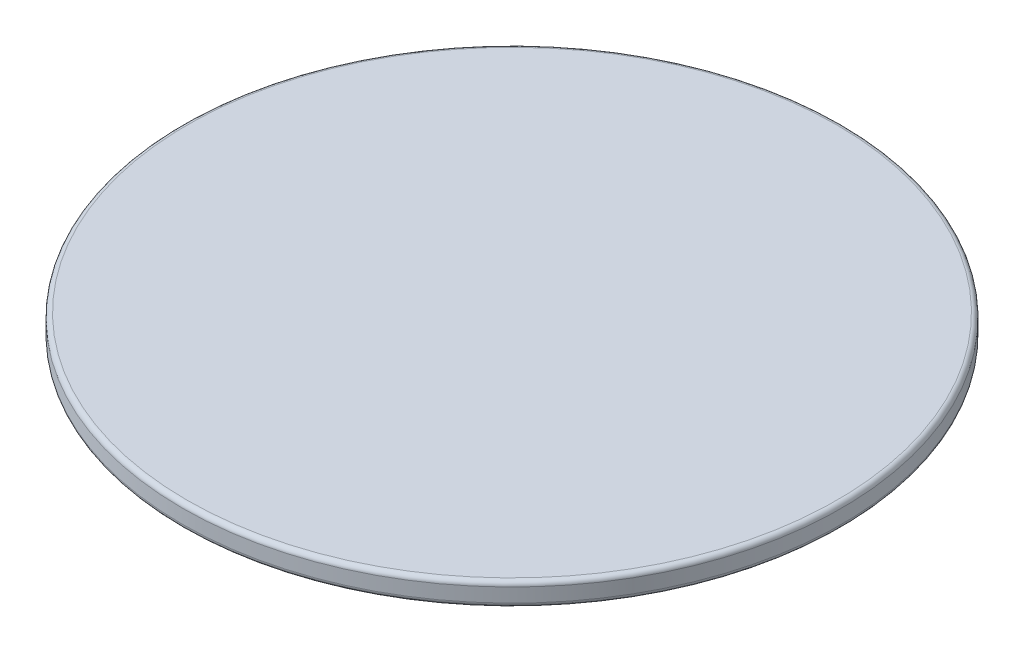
ISO-10303-21;
HEADER;
FILE_DESCRIPTION(('STEP AP214'),'2;1');
FILE_NAME('part.step','',(''),(''),'','','');
FILE_SCHEMA(('AUTOMOTIVE_DESIGN { 1 0 10303 214 1 1 1 1 }'));
ENDSEC;
DATA;
#1=APPLICATION_CONTEXT('core data for automotive mechanical design processes');
#2=APPLICATION_PROTOCOL_DEFINITION('international standard','automotive_design',2000,#1);
#3=PRODUCT_CONTEXT('',#1,'mechanical');
#4=PRODUCT('Part','Part','',(#3));
#5=PRODUCT_RELATED_PRODUCT_CATEGORY('part','',(#4));
#6=PRODUCT_DEFINITION_FORMATION('','',#4);
#7=PRODUCT_DEFINITION_CONTEXT('part definition',#1,'design');
#8=PRODUCT_DEFINITION('design','',#6,#7);
#9=PRODUCT_DEFINITION_SHAPE('','',#8);
#10=(LENGTH_UNIT() NAMED_UNIT(*) SI_UNIT(.MILLI.,.METRE.));
#11=(NAMED_UNIT(*) PLANE_ANGLE_UNIT() SI_UNIT($,.RADIAN.));
#12=(NAMED_UNIT(*) SI_UNIT($,.STERADIAN.) SOLID_ANGLE_UNIT());
#13=UNCERTAINTY_MEASURE_WITH_UNIT(LENGTH_MEASURE(1.E-05),#10,'distance_accuracy_value','');
#14=(GEOMETRIC_REPRESENTATION_CONTEXT(3) GLOBAL_UNCERTAINTY_ASSIGNED_CONTEXT((#13)) GLOBAL_UNIT_ASSIGNED_CONTEXT((#10,
#11,#12)) REPRESENTATION_CONTEXT('',''));
#15=CARTESIAN_POINT('',(0.,0.,0.));
#16=DIRECTION('',(0.,0.,1.));
#17=DIRECTION('',(1.,0.,0.));
#18=AXIS2_PLACEMENT_3D('',#15,#16,#17);
#19=CARTESIAN_POINT('',(-90.2335,19.05,0.));
#20=DIRECTION('',(0.,-1.,0.));
#21=DIRECTION('',(0.,0.,-1.));
#22=AXIS2_PLACEMENT_3D('',#19,#20,#21);
#23=PLANE('',#22);
#24=CARTESIAN_POINT('',(0.,19.05,0.));
#25=DIRECTION('',(0.,-1.,0.));
#26=DIRECTION('',(0.,0.,-1.));
#27=AXIS2_PLACEMENT_3D('',#24,#25,#26);
#28=CIRCLE('',#27,88.9635);
#29=CARTESIAN_POINT('',(0.,19.05,-88.9635));
#30=VERTEX_POINT('',#29);
#31=EDGE_CURVE('E10',#30,#30,#28,.F.);
#32=ORIENTED_EDGE('',*,*,#31,.T.);
#33=EDGE_LOOP('',(#32));
#34=FACE_BOUND('',#33,.T.);
#35=ADVANCED_FACE('F33',(#34),#23,.F.);
#36=CARTESIAN_POINT('',(0.,0.,0.));
#37=DIRECTION('',(0.,-1.,0.));
#38=DIRECTION('',(0.,0.,-1.));
#39=AXIS2_PLACEMENT_3D('',#36,#37,#38);
#40=CYLINDRICAL_SURFACE('',#39,90.2335);
#41=CARTESIAN_POINT('',(0.,13.97,0.));
#42=DIRECTION('',(0.,1.,0.));
#43=DIRECTION('',(0.,0.,1.));
#44=AXIS2_PLACEMENT_3D('',#41,#42,#43);
#45=CIRCLE('',#44,90.2335);
#46=CARTESIAN_POINT('',(0.,13.97,90.2335));
#47=VERTEX_POINT('',#46);
#48=EDGE_CURVE('E40',#47,#47,#45,.T.);
#49=ORIENTED_EDGE('',*,*,#48,.T.);
#50=EDGE_LOOP('',(#49));
#51=FACE_BOUND('',#50,.T.);
#52=CARTESIAN_POINT('',(0.,17.78,0.));
#53=DIRECTION('',(0.,-1.,0.));
#54=DIRECTION('',(0.,0.,-1.));
#55=AXIS2_PLACEMENT_3D('',#52,#53,#54);
#56=CIRCLE('',#55,90.2335);
#57=CARTESIAN_POINT('',(0.,17.78,-90.2335));
#58=VERTEX_POINT('',#57);
#59=EDGE_CURVE('E44',#58,#58,#56,.T.);
#60=ORIENTED_EDGE('',*,*,#59,.T.);
#61=EDGE_LOOP('',(#60));
#62=FACE_BOUND('',#61,.T.);
#63=ADVANCED_FACE('F103',(#51,#62),#40,.T.);
#64=CARTESIAN_POINT('',(-63.7540000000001,12.7,0.));
#65=DIRECTION('',(0.,1.,0.));
#66=DIRECTION('',(0.,0.,1.));
#67=AXIS2_PLACEMENT_3D('',#64,#65,#66);
#68=PLANE('',#67);
#69=CARTESIAN_POINT('',(0.,12.7,0.));
#70=DIRECTION('',(0.,1.,0.));
#71=DIRECTION('',(0.,0.,1.));
#72=AXIS2_PLACEMENT_3D('',#69,#70,#71);
#73=CIRCLE('',#72,88.9635);
#74=CARTESIAN_POINT('',(0.,12.7,88.9635));
#75=VERTEX_POINT('',#74);
#76=EDGE_CURVE('E48',#75,#75,#73,.F.);
#77=ORIENTED_EDGE('',*,*,#76,.T.);
#78=EDGE_LOOP('',(#77));
#79=FACE_BOUND('',#78,.T.);
#80=CARTESIAN_POINT('',(0.,12.7,0.));
#81=DIRECTION('',(0.,-1.,0.));
#82=DIRECTION('',(0.,0.,-1.));
#83=AXIS2_PLACEMENT_3D('',#80,#81,#82);
#84=CIRCLE('',#83,63.7540000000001);
#85=CARTESIAN_POINT('',(0.,12.7,-63.7540000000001));
#86=VERTEX_POINT('',#85);
#87=EDGE_CURVE('E59',#86,#86,#84,.T.);
#88=ORIENTED_EDGE('',*,*,#87,.F.);
#89=EDGE_LOOP('',(#88));
#90=FACE_BOUND('',#89,.T.);
#91=ADVANCED_FACE('F98',(#79,#90),#68,.F.);
#92=CARTESIAN_POINT('',(0.,0.,0.));
#93=DIRECTION('',(0.,-1.,0.));
#94=DIRECTION('',(0.,0.,-1.));
#95=AXIS2_PLACEMENT_3D('',#92,#93,#94);
#96=CYLINDRICAL_SURFACE('',#95,63.7540000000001);
#97=CARTESIAN_POINT('',(0.,7.61999999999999,0.));
#98=DIRECTION('',(0.,-1.,0.));
#99=DIRECTION('',(0.,0.,-1.));
#100=AXIS2_PLACEMENT_3D('',#97,#98,#99);
#101=CIRCLE('',#100,63.7540000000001);
#102=CARTESIAN_POINT('',(0.,7.61999999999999,-63.7540000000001));
#103=VERTEX_POINT('',#102);
#104=EDGE_CURVE('E62',#103,#103,#101,.T.);
#105=ORIENTED_EDGE('',*,*,#104,.F.);
#106=EDGE_LOOP('',(#105));
#107=FACE_BOUND('',#106,.T.);
#108=ORIENTED_EDGE('',*,*,#87,.T.);
#109=EDGE_LOOP('',(#108));
#110=FACE_BOUND('',#109,.T.);
#111=ADVANCED_FACE('F92',(#107,#110),#96,.T.);
#112=CARTESIAN_POINT('',(-59.9440000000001,7.61999999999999,0.));
#113=DIRECTION('',(0.,1.,0.));
#114=DIRECTION('',(0.,0.,1.));
#115=AXIS2_PLACEMENT_3D('',#112,#113,#114);
#116=PLANE('',#115);
#117=CARTESIAN_POINT('',(0.,7.61999999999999,0.));
#118=DIRECTION('',(0.,-1.,0.));
#119=DIRECTION('',(0.,0.,-1.));
#120=AXIS2_PLACEMENT_3D('',#117,#118,#119);
#121=CIRCLE('',#120,59.9440000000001);
#122=CARTESIAN_POINT('',(0.,7.61999999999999,-59.9440000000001));
#123=VERTEX_POINT('',#122);
#124=EDGE_CURVE('E65',#123,#123,#121,.T.);
#125=ORIENTED_EDGE('',*,*,#124,.F.);
#126=EDGE_LOOP('',(#125));
#127=FACE_BOUND('',#126,.T.);
#128=ORIENTED_EDGE('',*,*,#104,.T.);
#129=EDGE_LOOP('',(#128));
#130=FACE_BOUND('',#129,.T.);
#131=ADVANCED_FACE('F86',(#127,#130),#116,.F.);
#132=CARTESIAN_POINT('',(0.,0.,0.));
#133=DIRECTION('',(0.,-1.,0.));
#134=DIRECTION('',(0.,0.,-1.));
#135=AXIS2_PLACEMENT_3D('',#132,#133,#134);
#136=CYLINDRICAL_SURFACE('',#135,59.9440000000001);
#137=CARTESIAN_POINT('',(0.,3.80999999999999,0.));
#138=DIRECTION('',(0.,-1.,0.));
#139=DIRECTION('',(0.,0.,-1.));
#140=AXIS2_PLACEMENT_3D('',#137,#138,#139);
#141=CIRCLE('',#140,59.9440000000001);
#142=CARTESIAN_POINT('',(0.,3.80999999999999,-59.9440000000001));
#143=VERTEX_POINT('',#142);
#144=EDGE_CURVE('E68',#143,#143,#141,.T.);
#145=ORIENTED_EDGE('',*,*,#144,.F.);
#146=EDGE_LOOP('',(#145));
#147=FACE_BOUND('',#146,.T.);
#148=ORIENTED_EDGE('',*,*,#124,.T.);
#149=EDGE_LOOP('',(#148));
#150=FACE_BOUND('',#149,.T.);
#151=ADVANCED_FACE('F80',(#147,#150),#136,.T.);
#152=CARTESIAN_POINT('',(-59.9440000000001,3.80999999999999,0.));
#153=DIRECTION('',(0.,-1.,0.));
#154=DIRECTION('',(0.,0.,-1.));
#155=AXIS2_PLACEMENT_3D('',#152,#153,#154);
#156=PLANE('',#155);
#157=CARTESIAN_POINT('',(0.,3.80999999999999,0.));
#158=DIRECTION('',(0.,-1.,0.));
#159=DIRECTION('',(0.,0.,-1.));
#160=AXIS2_PLACEMENT_3D('',#157,#158,#159);
#161=CIRCLE('',#160,63.7540000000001);
#162=CARTESIAN_POINT('',(0.,3.80999999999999,-63.7540000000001));
#163=VERTEX_POINT('',#162);
#164=EDGE_CURVE('E71',#163,#163,#161,.T.);
#165=ORIENTED_EDGE('',*,*,#164,.F.);
#166=EDGE_LOOP('',(#165));
#167=FACE_BOUND('',#166,.T.);
#168=ORIENTED_EDGE('',*,*,#144,.T.);
#169=EDGE_LOOP('',(#168));
#170=FACE_BOUND('',#169,.T.);
#171=ADVANCED_FACE('F77',(#167,#170),#156,.F.);
#172=CARTESIAN_POINT('',(0.,0.,0.));
#173=DIRECTION('',(0.,-1.,0.));
#174=DIRECTION('',(0.,0.,-1.));
#175=AXIS2_PLACEMENT_3D('',#172,#173,#174);
#176=CYLINDRICAL_SURFACE('',#175,63.7540000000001);
#177=CARTESIAN_POINT('',(0.,1.27,0.));
#178=DIRECTION('',(0.,1.,0.));
#179=DIRECTION('',(0.,0.,1.));
#180=AXIS2_PLACEMENT_3D('',#177,#178,#179);
#181=CIRCLE('',#180,63.7540000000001);
#182=CARTESIAN_POINT('',(0.,1.27,63.7540000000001));
#183=VERTEX_POINT('',#182);
#184=EDGE_CURVE('E53',#183,#183,#181,.T.);
#185=ORIENTED_EDGE('',*,*,#184,.T.);
#186=EDGE_LOOP('',(#185));
#187=FACE_BOUND('',#186,.T.);
#188=ORIENTED_EDGE('',*,*,#164,.T.);
#189=EDGE_LOOP('',(#188));
#190=FACE_BOUND('',#189,.T.);
#191=ADVANCED_FACE('F75',(#187,#190),#176,.T.);
#192=CARTESIAN_POINT('',(-63.7540000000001,0.,0.));
#193=DIRECTION('',(0.,1.,0.));
#194=DIRECTION('',(0.,0.,1.));
#195=AXIS2_PLACEMENT_3D('',#192,#193,#194);
#196=PLANE('',#195);
#197=CARTESIAN_POINT('',(0.,0.,0.));
#198=DIRECTION('',(0.,1.,0.));
#199=DIRECTION('',(0.,0.,1.));
#200=AXIS2_PLACEMENT_3D('',#197,#198,#199);
#201=CIRCLE('',#200,62.4840000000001);
#202=CARTESIAN_POINT('',(0.,0.,62.4840000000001));
#203=VERTEX_POINT('',#202);
#204=EDGE_CURVE('E56',#203,#203,#201,.F.);
#205=ORIENTED_EDGE('',*,*,#204,.T.);
#206=EDGE_LOOP('',(#205));
#207=FACE_BOUND('',#206,.T.);
#208=ADVANCED_FACE('F118',(#207),#196,.F.);
#209=CARTESIAN_POINT('',(0.,1.27,0.));
#210=DIRECTION('',(0.,1.,0.));
#211=DIRECTION('',(0.,0.,1.));
#212=AXIS2_PLACEMENT_3D('',#209,#210,#211);
#213=TOROIDAL_SURFACE('',#212,62.4840000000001,1.27);
#214=ORIENTED_EDGE('',*,*,#184,.F.);
#215=EDGE_LOOP('',(#214));
#216=FACE_BOUND('',#215,.T.);
#217=ORIENTED_EDGE('',*,*,#204,.F.);
#218=EDGE_LOOP('',(#217));
#219=FACE_BOUND('',#218,.T.);
#220=ADVANCED_FACE('F115',(#216,#219),#213,.T.);
#221=CARTESIAN_POINT('',(0.,13.97,0.));
#222=DIRECTION('',(0.,1.,0.));
#223=DIRECTION('',(0.,0.,1.));
#224=AXIS2_PLACEMENT_3D('',#221,#222,#223);
#225=TOROIDAL_SURFACE('',#224,88.9635,1.27);
#226=ORIENTED_EDGE('',*,*,#48,.F.);
#227=EDGE_LOOP('',(#226));
#228=FACE_BOUND('',#227,.T.);
#229=ORIENTED_EDGE('',*,*,#76,.F.);
#230=EDGE_LOOP('',(#229));
#231=FACE_BOUND('',#230,.T.);
#232=ADVANCED_FACE('F117',(#228,#231),#225,.T.);
#233=CARTESIAN_POINT('',(0.,17.78,0.));
#234=DIRECTION('',(0.,-1.,0.));
#235=DIRECTION('',(0.,0.,-1.));
#236=AXIS2_PLACEMENT_3D('',#233,#234,#235);
#237=TOROIDAL_SURFACE('',#236,88.9635,1.27);
#238=ORIENTED_EDGE('',*,*,#31,.F.);
#239=EDGE_LOOP('',(#238));
#240=FACE_BOUND('',#239,.T.);
#241=ORIENTED_EDGE('',*,*,#59,.F.);
#242=EDGE_LOOP('',(#241));
#243=FACE_BOUND('',#242,.T.);
#244=ADVANCED_FACE('F35',(#240,#243),#237,.T.);
#245=CLOSED_SHELL('',(#35,#63,#91,#111,#131,#151,#171,#191,#208,#220,#232,#244));
#246=MANIFOLD_SOLID_BREP('B2',#245);
#247=ADVANCED_BREP_SHAPE_REPRESENTATION('',(#18,#246),#14);
#248=SHAPE_DEFINITION_REPRESENTATION(#9,#247);
ENDSEC;
END-ISO-10303-21;
